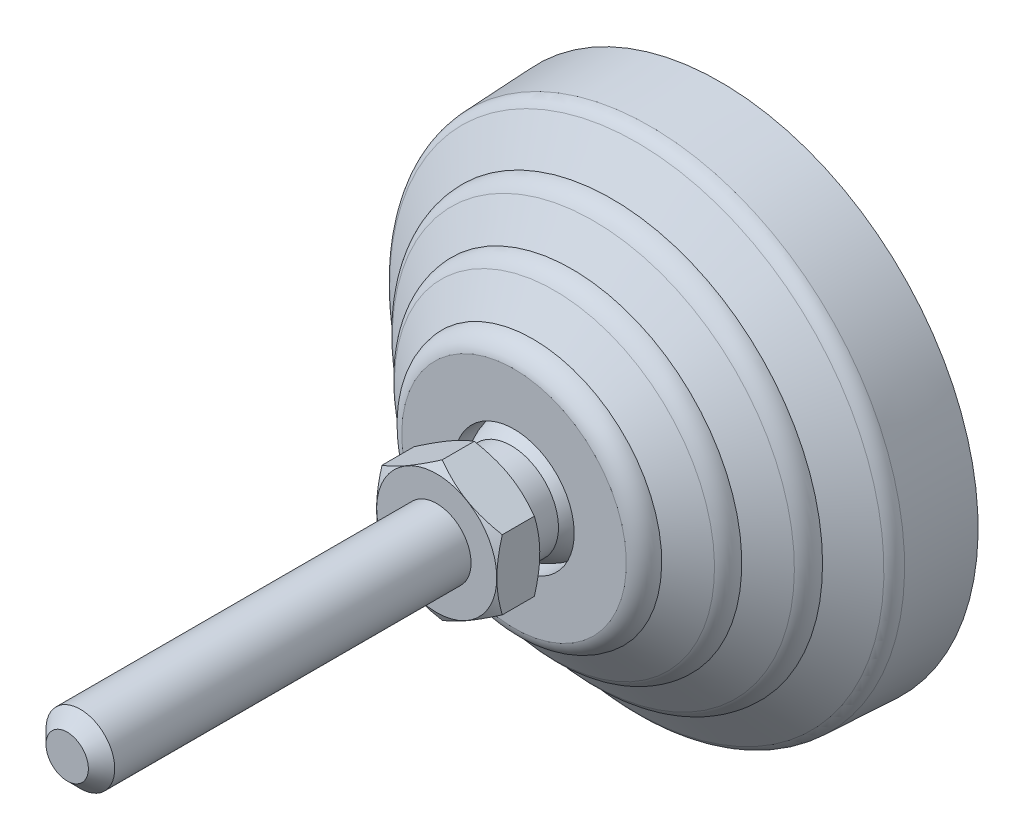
ISO-10303-21;
HEADER;
FILE_DESCRIPTION(('STEP AP214'),'2;1');
FILE_NAME('part.step','',(''),(''),'','','');
FILE_SCHEMA(('AUTOMOTIVE_DESIGN { 1 0 10303 214 1 1 1 1 }'));
ENDSEC;
DATA;
#1=APPLICATION_CONTEXT('core data for automotive mechanical design processes');
#2=APPLICATION_PROTOCOL_DEFINITION('international standard','automotive_design',2000,#1);
#3=PRODUCT_CONTEXT('',#1,'mechanical');
#4=PRODUCT('Part','Part','',(#3));
#5=PRODUCT_RELATED_PRODUCT_CATEGORY('part','',(#4));
#6=PRODUCT_DEFINITION_FORMATION('','',#4);
#7=PRODUCT_DEFINITION_CONTEXT('part definition',#1,'design');
#8=PRODUCT_DEFINITION('design','',#6,#7);
#9=PRODUCT_DEFINITION_SHAPE('','',#8);
#10=(LENGTH_UNIT() NAMED_UNIT(*) SI_UNIT(.MILLI.,.METRE.));
#11=(NAMED_UNIT(*) PLANE_ANGLE_UNIT() SI_UNIT($,.RADIAN.));
#12=(NAMED_UNIT(*) SI_UNIT($,.STERADIAN.) SOLID_ANGLE_UNIT());
#13=UNCERTAINTY_MEASURE_WITH_UNIT(LENGTH_MEASURE(1.E-05),#10,'distance_accuracy_value','');
#14=(GEOMETRIC_REPRESENTATION_CONTEXT(3) GLOBAL_UNCERTAINTY_ASSIGNED_CONTEXT((#13)) GLOBAL_UNIT_ASSIGNED_CONTEXT((#10,
#11,#12)) REPRESENTATION_CONTEXT('',''));
#15=CARTESIAN_POINT('',(0.,0.,0.));
#16=DIRECTION('',(0.,0.,1.));
#17=DIRECTION('',(1.,0.,0.));
#18=AXIS2_PLACEMENT_3D('',#15,#16,#17);
#19=CARTESIAN_POINT('',(0.6165,-1.06780932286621,76.));
#20=DIRECTION('',(0.,0.,1.));
#21=DIRECTION('',(-0.866025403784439,-0.5,0.));
#22=AXIS2_PLACEMENT_3D('',#19,#20,#21);
#23=PLANE('',#22);
#24=CARTESIAN_POINT('',(0.,0.,76.0000000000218));
#25=DIRECTION('',(0.,0.,-1.));
#26=DIRECTION('',(0.866025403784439,0.5,0.));
#27=AXIS2_PLACEMENT_3D('',#24,#25,#26);
#28=CIRCLE('',#27,2.46600000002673);
#29=CARTESIAN_POINT('',(2.13561864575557,1.23300000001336,76.0000000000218));
#30=VERTEX_POINT('',#29);
#31=EDGE_CURVE('E133',#30,#30,#28,.T.);
#32=ORIENTED_EDGE('',*,*,#31,.F.);
#33=EDGE_LOOP('',(#32));
#34=FACE_BOUND('',#33,.T.);
#35=ADVANCED_FACE('F14',(#34),#23,.T.);
#36=CARTESIAN_POINT('',(0.,0.,74.4660000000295));
#37=DIRECTION('',(0.,0.,-1.));
#38=DIRECTION('',(0.866025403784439,0.5,0.));
#39=AXIS2_PLACEMENT_3D('',#36,#37,#38);
#40=CONICAL_SURFACE('',#39,4.0000000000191,0.785398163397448);
#41=CARTESIAN_POINT('',(0.,0.,74.466));
#42=DIRECTION('',(0.,0.,-1.));
#43=DIRECTION('',(0.866025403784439,0.5,0.));
#44=AXIS2_PLACEMENT_3D('',#41,#42,#43);
#45=CIRCLE('',#44,4.);
#46=CARTESIAN_POINT('',(3.46410161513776,2.,74.466));
#47=VERTEX_POINT('',#46);
#48=EDGE_CURVE('E9',#47,#47,#45,.T.);
#49=ORIENTED_EDGE('',*,*,#48,.F.);
#50=EDGE_LOOP('',(#49));
#51=FACE_BOUND('',#50,.T.);
#52=ORIENTED_EDGE('',*,*,#31,.T.);
#53=EDGE_LOOP('',(#52));
#54=FACE_BOUND('',#53,.T.);
#55=ADVANCED_FACE('F309',(#51,#54),#40,.T.);
#56=CARTESIAN_POINT('',(0.,0.,53.733));
#57=DIRECTION('',(0.,0.,-1.));
#58=DIRECTION('',(0.866025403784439,0.5,0.));
#59=AXIS2_PLACEMENT_3D('',#56,#57,#58);
#60=CYLINDRICAL_SURFACE('',#59,4.);
#61=CARTESIAN_POINT('',(0.,0.,33.));
#62=DIRECTION('',(0.,0.,-1.));
#63=DIRECTION('',(0.866025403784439,0.5,0.));
#64=AXIS2_PLACEMENT_3D('',#61,#62,#63);
#65=CIRCLE('',#64,4.);
#66=CARTESIAN_POINT('',(3.46410161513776,2.,33.));
#67=VERTEX_POINT('',#66);
#68=EDGE_CURVE('E26',#67,#67,#65,.F.);
#69=ORIENTED_EDGE('',*,*,#68,.T.);
#70=EDGE_LOOP('',(#69));
#71=FACE_BOUND('',#70,.T.);
#72=ORIENTED_EDGE('',*,*,#48,.T.);
#73=EDGE_LOOP('',(#72));
#74=FACE_BOUND('',#73,.T.);
#75=ADVANCED_FACE('F315',(#71,#74),#60,.T.);
#76=CARTESIAN_POINT('',(2.7475,-4.75880959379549,33.));
#77=DIRECTION('',(0.,0.,1.));
#78=DIRECTION('',(-0.866025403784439,-0.5,0.));
#79=AXIS2_PLACEMENT_3D('',#76,#77,#78);
#80=PLANE('',#79);
#81=CARTESIAN_POINT('',(0.,0.,33.));
#82=DIRECTION('',(0.,0.,-1.));
#83=DIRECTION('',(0.866025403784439,0.5,0.));
#84=AXIS2_PLACEMENT_3D('',#81,#82,#83);
#85=CIRCLE('',#84,6.99);
#86=CARTESIAN_POINT('',(6.05351757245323,3.495,33.));
#87=VERTEX_POINT('',#86);
#88=EDGE_CURVE('E136',#87,#87,#85,.F.);
#89=ORIENTED_EDGE('',*,*,#88,.T.);
#90=EDGE_LOOP('',(#89));
#91=FACE_BOUND('',#90,.T.);
#92=ORIENTED_EDGE('',*,*,#68,.F.);
#93=EDGE_LOOP('',(#92));
#94=FACE_BOUND('',#93,.T.);
#95=ADVANCED_FACE('F161',(#91,#94),#80,.T.);
#96=CARTESIAN_POINT('',(0.,0.,32.3652257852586));
#97=DIRECTION('',(0.,0.,-1.));
#98=DIRECTION('',(0.866025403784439,0.5,0.));
#99=AXIS2_PLACEMENT_3D('',#96,#97,#98);
#100=CONICAL_SURFACE('',#99,8.08946119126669,1.0471975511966);
#101=ORIENTED_EDGE('',*,*,#88,.F.);
#102=EDGE_LOOP('',(#101));
#103=FACE_BOUND('',#102,.T.);
#104=CARTESIAN_POINT('',(-7.00000002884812,-4.0414518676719,32.3690117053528));
#105=CARTESIAN_POINT('',(-6.84613380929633,-4.13028657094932,32.4202905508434));
#106=CARTESIAN_POINT('',(-6.69169390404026,-4.21945249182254,32.4692419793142));
#107=CARTESIAN_POINT('',(-6.38155989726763,-4.39850844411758,32.5618490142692));
#108=CARTESIAN_POINT('',(-6.22586528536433,-4.48839877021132,32.6055023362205));
#109=CARTESIAN_POINT('',(-5.75628875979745,-4.75950890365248,32.7276582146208));
#110=CARTESIAN_POINT('',(-5.44055332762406,-4.94179884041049,32.79713799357));
#111=CARTESIAN_POINT('',(-4.96806103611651,-5.2145923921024,32.8786092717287));
#112=CARTESIAN_POINT('',(-4.81271579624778,-5.30428100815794,32.9018176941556));
#113=CARTESIAN_POINT('',(-4.50132349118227,-5.48406343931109,32.9407338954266));
#114=CARTESIAN_POINT('',(-4.34527648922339,-5.57415721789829,32.9564423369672));
#115=CARTESIAN_POINT('',(-4.03291155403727,-5.75450119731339,32.9799582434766));
#116=CARTESIAN_POINT('',(-3.87659413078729,-5.84475110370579,32.9877746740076));
#117=CARTESIAN_POINT('',(-3.56382362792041,-6.02532923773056,32.9953473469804));
#118=CARTESIAN_POINT('',(-3.40737055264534,-6.11565746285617,32.9951038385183));
#119=CARTESIAN_POINT('',(-2.97876700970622,-6.36311183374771,32.9833586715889));
#120=CARTESIAN_POINT('',(-2.70675692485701,-6.52015692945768,32.9636515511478));
#121=CARTESIAN_POINT('',(-2.16454337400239,-6.83320406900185,32.9011668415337));
#122=CARTESIAN_POINT('',(-1.89434181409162,-6.9892050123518,32.8583679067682));
#123=CARTESIAN_POINT('',(-1.35103755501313,-7.30288187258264,32.7513856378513));
#124=CARTESIAN_POINT('',(-1.07800339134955,-7.46051822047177,32.6867491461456));
#125=CARTESIAN_POINT('',(-0.536006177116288,-7.77344045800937,32.5400514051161));
#126=CARTESIAN_POINT('',(-0.267036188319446,-7.92873035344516,32.4580246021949));
#127=CARTESIAN_POINT('',(-7.50026516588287E-08,-8.08290372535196,32.3690117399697));
#128=B_SPLINE_CURVE_WITH_KNOTS('',3,(#104,#105,#106,#107,#108,#109,#110,#111,#112,#113,#114,
#115,#116,#117,#118,#119,#120,#121,#122,#123,#124,#125,#126,#127),.UNSPECIFIED.,.F.,.F.,(4,2,2,
2,2,2,2,2,2,2,2,4),(0.,0.554720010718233,1.1096783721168,2.22190069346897,2.76439121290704,
3.30683378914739,3.84865943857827,4.39046834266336,5.33360245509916,6.27760987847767,
7.24255086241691,8.20559807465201),.UNSPECIFIED.);
#129=CARTESIAN_POINT('',(-7.00000001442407,-4.04145187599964,32.3690117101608));
#130=VERTEX_POINT('',#129);
#131=CARTESIAN_POINT('',(-1.44240652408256E-08,-8.0829037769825,32.3690117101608));
#132=VERTEX_POINT('',#131);
#133=EDGE_CURVE('E147',#130,#132,#128,.T.);
#134=ORIENTED_EDGE('',*,*,#133,.T.);
#135=CARTESIAN_POINT('',(-2.88481257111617E-08,-8.08290378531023,32.3690117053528));
#136=CARTESIAN_POINT('',(0.287315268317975,-7.91702222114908,32.4647934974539));
#137=CARTESIAN_POINT('',(0.576903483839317,-7.7498283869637,32.5524844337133));
#138=CARTESIAN_POINT('',(1.16078407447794,-7.41272477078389,32.7074672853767));
#139=CARTESIAN_POINT('',(1.45508545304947,-7.24280979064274,32.7747135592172));
#140=CARTESIAN_POINT('',(2.04038588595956,-6.90488642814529,32.882853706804));
#141=CARTESIAN_POINT('',(2.33130253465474,-6.73692562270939,32.9243241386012));
#142=CARTESIAN_POINT('',(2.91481423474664,-6.40003498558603,32.9799957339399));
#143=CARTESIAN_POINT('',(3.20740711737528,-6.23110640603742,32.9942264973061));
#144=CARTESIAN_POINT('',(3.79259287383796,-5.89324925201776,32.9942264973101));
#145=CARTESIAN_POINT('',(4.085185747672,-5.72432067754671,32.9799957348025));
#146=CARTESIAN_POINT('',(4.66869743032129,-5.38743005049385,32.9243241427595));
#147=CARTESIAN_POINT('',(4.95961407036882,-5.21946925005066,32.8828537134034));
#148=CARTESIAN_POINT('',(5.54491448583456,-4.88154589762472,32.7747135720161));
#149=CARTESIAN_POINT('',(5.83921585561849,-4.71163092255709,32.7074673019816));
#150=CARTESIAN_POINT('',(6.42309642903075,-4.37452731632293,32.5524844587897));
#151=CARTESIAN_POINT('',(6.71268463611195,-4.20733348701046,32.4647935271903));
#152=CARTESIAN_POINT('',(6.99999992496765,-4.04145192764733,32.3690117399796));
#153=B_SPLINE_CURVE_WITH_KNOTS('',3,(#135,#136,#137,#138,#139,#140,#141,#142,#143,#144,#145,
#146,#147,#148,#149,#150,#151,#152),.UNSPECIFIED.,.F.,.F.,(4,2,2,2,2,2,2,2,4),(0.,
1.03625689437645,2.07481046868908,3.08920803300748,4.10250268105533,5.11579729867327,
6.13019483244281,7.1687483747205,8.20500523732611),.UNSPECIFIED.);
#154=CARTESIAN_POINT('',(7.,-4.04145190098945,32.3690117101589));
#155=VERTEX_POINT('',#154);
#156=EDGE_CURVE('E139',#132,#155,#153,.T.);
#157=ORIENTED_EDGE('',*,*,#156,.T.);
#158=CARTESIAN_POINT('',(7.,-4.04145191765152,32.3690117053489));
#159=CARTESIAN_POINT('',(7.,-3.86378251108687,32.4202905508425));
#160=CARTESIAN_POINT('',(7.,-3.68545066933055,32.4692419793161));
#161=CARTESIAN_POINT('',(7.,-3.32733876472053,32.5618490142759));
#162=CARTESIAN_POINT('',(7.,-3.14755811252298,32.6055023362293));
#163=CARTESIAN_POINT('',(7.,-2.6053378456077,32.7276582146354));
#164=CARTESIAN_POINT('',(7.,-2.24075797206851,32.797137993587));
#165=CARTESIAN_POINT('',(7.,-1.69517086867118,32.8786092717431));
#166=CARTESIAN_POINT('',(7.,-1.51579363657,32.9018176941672));
#167=CARTESIAN_POINT('',(7.,-1.15622877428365,32.9407338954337));
#168=CARTESIAN_POINT('',(7.,-0.976041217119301,32.9564423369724));
#169=CARTESIAN_POINT('',(7.,-0.615353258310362,32.9799582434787));
#170=CARTESIAN_POINT('',(7.,-0.434853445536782,32.9877746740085));
#171=CARTESIAN_POINT('',(7.,-0.0736971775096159,32.9953473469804));
#172=CARTESIAN_POINT('',(7.,0.106959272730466,32.9951038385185));
#173=CARTESIAN_POINT('',(7.,0.60186801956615,32.9833586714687));
#174=CARTESIAN_POINT('',(7.,0.915958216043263,32.9636515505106));
#175=CARTESIAN_POINT('',(7.,1.54205250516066,32.9011668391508));
#176=CARTESIAN_POINT('',(7.,1.85405439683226,32.8583679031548));
#177=CARTESIAN_POINT('',(7.,2.48140812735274,32.7513856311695));
#178=CARTESIAN_POINT('',(7.,2.79668082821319,32.6867491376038));
#179=CARTESIAN_POINT('',(7.,3.42252531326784,32.5400513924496));
#180=CARTESIAN_POINT('',(7.,3.73310510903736,32.4580245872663));
#181=CARTESIAN_POINT('',(7.,4.04145185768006,32.3690117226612));
#182=B_SPLINE_CURVE_WITH_KNOTS('',3,(#158,#159,#160,#161,#162,#163,#164,#165,#166,#167,#168,
#169,#170,#171,#172,#173,#174,#175,#176,#177,#178,#179,#180,#181),.UNSPECIFIED.,.F.,.F.,(4,2,2,
2,2,2,2,2,2,2,2,4),(0.,0.554720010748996,1.10967837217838,2.22190069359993,2.7643912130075,
3.30683378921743,3.84865943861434,4.39046834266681,5.33360247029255,6.27760990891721,
7.24255090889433,8.20559813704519),.UNSPECIFIED.);
#183=CARTESIAN_POINT('',(6.99999998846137,4.04145189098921,32.369011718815));
#184=VERTEX_POINT('',#183);
#185=EDGE_CURVE('E184',#155,#184,#182,.T.);
#186=ORIENTED_EDGE('',*,*,#185,.T.);
#187=CARTESIAN_POINT('',(6.99999997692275,4.04145189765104,32.3690117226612));
#188=CARTESIAN_POINT('',(6.84613375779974,4.1302866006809,32.4202905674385));
#189=CARTESIAN_POINT('',(6.69169385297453,4.21945252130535,32.4692419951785));
#190=CARTESIAN_POINT('',(6.38155984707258,4.39850847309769,32.5618490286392));
#191=CARTESIAN_POINT('',(6.22586523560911,4.48839879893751,32.6055023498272));
#192=CARTESIAN_POINT('',(5.75628871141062,4.75950893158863,32.7276582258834));
#193=CARTESIAN_POINT('',(5.44055328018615,4.94179886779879,32.7971380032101));
#194=CARTESIAN_POINT('',(4.96806099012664,5.21459241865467,32.878609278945));
#195=CARTESIAN_POINT('',(4.81271575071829,5.3042810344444,32.9018177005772));
#196=CARTESIAN_POINT('',(4.50132344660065,5.4840634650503,32.9407339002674));
#197=CARTESIAN_POINT('',(4.34527644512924,5.57415724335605,32.9564423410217));
#198=CARTESIAN_POINT('',(4.03291151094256,5.75450122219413,32.9799582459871));
#199=CARTESIAN_POINT('',(3.8765940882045,5.84475112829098,32.98777467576));
#200=CARTESIAN_POINT('',(3.56382358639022,6.02532926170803,32.9953473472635));
#201=CARTESIAN_POINT('',(3.40737051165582,6.11565748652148,32.99510383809));
#202=CARTESIAN_POINT('',(2.97876697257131,6.36311185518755,32.9833586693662));
#203=CARTESIAN_POINT('',(2.70675689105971,6.52015694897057,32.9636515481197));
#204=CARTESIAN_POINT('',(2.16454334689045,6.83320408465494,32.9011668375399));
#205=CARTESIAN_POINT('',(1.89434179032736,6.9892050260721,32.8583679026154));
#206=CARTESIAN_POINT('',(1.35103753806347,7.30288188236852,32.7513856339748));
#207=CARTESIAN_POINT('',(1.07800337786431,7.46051822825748,32.6867491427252));
#208=CARTESIAN_POINT('',(0.536006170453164,7.77344046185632,32.5400514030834));
#209=CARTESIAN_POINT('',(0.267036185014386,7.92873035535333,32.4580246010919));
#210=CARTESIAN_POINT('',(7.50026516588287E-08,8.08290372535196,32.3690117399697));
#211=B_SPLINE_CURVE_WITH_KNOTS('',3,(#187,#188,#189,#190,#191,#192,#193,#194,#195,#196,#197,
#198,#199,#200,#201,#202,#203,#204,#205,#206,#207,#208,#209,#210),.UNSPECIFIED.,.F.,.F.,(4,2,2,
2,2,2,2,2,2,2,2,4),(0.,0.554720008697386,1.10967836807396,2.22190068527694,2.76439120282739,
3.30683377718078,3.8486594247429,4.390468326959,5.33360242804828,6.27760984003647,
7.24255081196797,8.20559801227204),.UNSPECIFIED.);
#212=CARTESIAN_POINT('',(1.44240652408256E-08,8.0829037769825,32.3690117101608));
#213=VERTEX_POINT('',#212);
#214=EDGE_CURVE('E176',#184,#213,#211,.T.);
#215=ORIENTED_EDGE('',*,*,#214,.T.);
#216=CARTESIAN_POINT('',(2.88481257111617E-08,8.08290378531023,32.3690117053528));
#217=CARTESIAN_POINT('',(-0.287315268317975,7.91702222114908,32.4647934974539));
#218=CARTESIAN_POINT('',(-0.576903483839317,7.7498283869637,32.5524844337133));
#219=CARTESIAN_POINT('',(-1.16078407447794,7.41272477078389,32.7074672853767));
#220=CARTESIAN_POINT('',(-1.45508545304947,7.24280979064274,32.7747135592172));
#221=CARTESIAN_POINT('',(-2.04038588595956,6.90488642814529,32.882853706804));
#222=CARTESIAN_POINT('',(-2.33130253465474,6.73692562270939,32.9243241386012));
#223=CARTESIAN_POINT('',(-2.91481423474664,6.40003498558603,32.9799957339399));
#224=CARTESIAN_POINT('',(-3.20740711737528,6.23110640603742,32.9942264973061));
#225=CARTESIAN_POINT('',(-3.79259287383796,5.89324925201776,32.9942264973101));
#226=CARTESIAN_POINT('',(-4.085185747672,5.72432067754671,32.9799957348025));
#227=CARTESIAN_POINT('',(-4.66869743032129,5.38743005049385,32.9243241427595));
#228=CARTESIAN_POINT('',(-4.95961407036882,5.21946925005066,32.8828537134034));
#229=CARTESIAN_POINT('',(-5.54491448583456,4.88154589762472,32.7747135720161));
#230=CARTESIAN_POINT('',(-5.83921585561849,4.71163092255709,32.7074673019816));
#231=CARTESIAN_POINT('',(-6.42309642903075,4.37452731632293,32.5524844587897));
#232=CARTESIAN_POINT('',(-6.71268463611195,4.20733348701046,32.4647935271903));
#233=CARTESIAN_POINT('',(-6.99999992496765,4.04145192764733,32.3690117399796));
#234=B_SPLINE_CURVE_WITH_KNOTS('',3,(#216,#217,#218,#219,#220,#221,#222,#223,#224,#225,#226,
#227,#228,#229,#230,#231,#232,#233),.UNSPECIFIED.,.F.,.F.,(4,2,2,2,2,2,2,2,4),(0.,
1.03625689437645,2.07481046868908,3.08920803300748,4.10250268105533,5.11579729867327,
6.13019483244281,7.1687483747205,8.20500523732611),.UNSPECIFIED.);
#235=CARTESIAN_POINT('',(-7.,4.04145190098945,32.3690117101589));
#236=VERTEX_POINT('',#235);
#237=EDGE_CURVE('E343',#213,#236,#234,.T.);
#238=ORIENTED_EDGE('',*,*,#237,.T.);
#239=CARTESIAN_POINT('',(-7.,4.04145191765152,32.3690117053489));
#240=CARTESIAN_POINT('',(-7.,3.86378251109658,32.4202905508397));
#241=CARTESIAN_POINT('',(-7.,3.68545066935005,32.4692419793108));
#242=CARTESIAN_POINT('',(-7.,3.32733876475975,32.5618490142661));
#243=CARTESIAN_POINT('',(-7.,3.14755811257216,32.6055023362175));
#244=CARTESIAN_POINT('',(-7.,2.60533784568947,32.7276582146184));
#245=CARTESIAN_POINT('',(-7.,2.24075797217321,32.7971379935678));
#246=CARTESIAN_POINT('',(-7.,1.69517086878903,32.8786092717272));
#247=CARTESIAN_POINT('',(-7.,1.51579363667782,32.9018176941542));
#248=CARTESIAN_POINT('',(-7.,1.15622877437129,32.9407338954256));
#249=CARTESIAN_POINT('',(-7.,0.97604121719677,32.9564423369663));
#250=CARTESIAN_POINT('',(-7.,0.615353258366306,32.9799582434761));
#251=CARTESIAN_POINT('',(-7.,0.434853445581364,32.9877746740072));
#252=CARTESIAN_POINT('',(-7.,0.0736971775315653,32.9953473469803));
#253=CARTESIAN_POINT('',(-7.,-0.106959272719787,32.9951038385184));
#254=CARTESIAN_POINT('',(-7.,-0.601868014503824,32.9833586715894));
#255=CARTESIAN_POINT('',(-7.,-0.915958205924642,32.9636515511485));
#256=CARTESIAN_POINT('',(-7.,-1.54205248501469,32.9011668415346));
#257=CARTESIAN_POINT('',(-7.,-1.85405437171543,32.8583679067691));
#258=CARTESIAN_POINT('',(-7.,-2.48140809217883,32.7513856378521));
#259=CARTESIAN_POINT('',(-7.,-2.79668078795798,32.6867491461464));
#260=CARTESIAN_POINT('',(-7.,-3.42252526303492,32.5400514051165));
#261=CARTESIAN_POINT('',(-7.,-3.73310505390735,32.4580246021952));
#262=CARTESIAN_POINT('',(-7.,-4.0414517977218,32.3690117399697));
#263=B_SPLINE_CURVE_WITH_KNOTS('',3,(#239,#240,#241,#242,#243,#244,#245,#246,#247,#248,#249,
#250,#251,#252,#253,#254,#255,#256,#257,#258,#259,#260,#261,#262),.UNSPECIFIED.,.F.,.F.,(4,2,2,
2,2,2,2,2,2,2,2,4),(0.,0.554720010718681,1.1096783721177,2.22190069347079,2.76439121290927,
3.30683378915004,3.84865943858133,4.39046834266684,5.33360245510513,6.27760987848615,
7.24255086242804,8.20559807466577),.UNSPECIFIED.);
#264=EDGE_CURVE('E166',#236,#130,#263,.T.);
#265=ORIENTED_EDGE('',*,*,#264,.T.);
#266=EDGE_LOOP('',(#134,#157,#186,#215,#238,#265));
#267=FACE_BOUND('',#266,.T.);
#268=ADVANCED_FACE('F156',(#103,#267),#100,.T.);
#269=CARTESIAN_POINT('',(-7.,-4.04145188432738,33.1));
#270=DIRECTION('',(1.,0.,0.));
#271=DIRECTION('',(0.,1.,0.));
#272=AXIS2_PLACEMENT_3D('',#269,#270,#271);
#273=PLANE('',#272);
#274=DIRECTION('',(0.,0.,1.));
#275=VECTOR('',#274,1.);
#276=CARTESIAN_POINT('',(-7.,-4.04145188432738,33.1));
#277=LINE('',#276,#275);
#278=CARTESIAN_POINT('',(-7.,-4.04145188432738,28.6309882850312));
#279=VERTEX_POINT('',#278);
#280=EDGE_CURVE('E369',#279,#130,#277,.T.);
#281=ORIENTED_EDGE('',*,*,#280,.T.);
#282=ORIENTED_EDGE('',*,*,#264,.F.);
#283=DIRECTION('',(0.,0.,1.));
#284=VECTOR('',#283,1.);
#285=CARTESIAN_POINT('',(-7.,4.04145188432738,33.1));
#286=LINE('',#285,#284);
#287=CARTESIAN_POINT('',(-7.,4.04145188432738,28.6309882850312));
#288=VERTEX_POINT('',#287);
#289=EDGE_CURVE('E361',#288,#236,#286,.T.);
#290=ORIENTED_EDGE('',*,*,#289,.F.);
#291=CARTESIAN_POINT('',(-7.,-4.04145188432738,28.6309882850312));
#292=CARTESIAN_POINT('',(-7.,-3.86378247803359,28.5797094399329));
#293=CARTESIAN_POINT('',(-7.,-3.68545063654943,28.5307580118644));
#294=CARTESIAN_POINT('',(-7.,-3.32733873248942,28.4381509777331));
#295=CARTESIAN_POINT('',(-7.,-3.14755808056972,28.3944976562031));
#296=CARTESIAN_POINT('',(-7.,-2.60533781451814,28.2723417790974));
#297=CARTESIAN_POINT('',(-7.,-2.24075794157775,28.2028620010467));
#298=CARTESIAN_POINT('',(-7.,-1.69517083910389,28.1213907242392));
#299=CARTESIAN_POINT('',(-7.,-1.51579360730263,28.098182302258));
#300=CARTESIAN_POINT('',(-7.,-1.15622874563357,28.0592661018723));
#301=CARTESIAN_POINT('',(-7.,-0.976041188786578,28.0435576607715));
#302=CARTESIAN_POINT('',(-7.,-0.615353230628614,28.0200417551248));
#303=CARTESIAN_POINT('',(-7.,-0.434853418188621,28.012225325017));
#304=CARTESIAN_POINT('',(-7.,-0.0736971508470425,28.0046526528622));
#305=CARTESIAN_POINT('',(-7.,0.10695929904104,28.0048961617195));
#306=CARTESIAN_POINT('',(-7.,0.601868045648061,28.0166413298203));
#307=CARTESIAN_POINT('',(-7.,0.91595824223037,28.0363484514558));
#308=CARTESIAN_POINT('',(-7.,1.54205253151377,28.0988331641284));
#309=CARTESIAN_POINT('',(-7.,1.85405442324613,28.1416321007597));
#310=CARTESIAN_POINT('',(-7.,2.48140815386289,28.248614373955));
#311=CARTESIAN_POINT('',(-7.,2.79668085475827,28.3132508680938));
#312=CARTESIAN_POINT('',(-7.,3.4225253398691,28.4599486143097));
#313=CARTESIAN_POINT('',(-7.,3.73310513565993,28.5419754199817));
#314=CARTESIAN_POINT('',(-7.,4.04145188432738,28.6309882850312));
#315=B_SPLINE_CURVE_WITH_KNOTS('',3,(#291,#292,#293,#294,#295,#296,#297,#298,#299,#300,#301,
#302,#303,#304,#305,#306,#307,#308,#309,#310,#311,#312,#313,#314),.UNSPECIFIED.,.F.,.F.,(4,2,2,
2,2,2,2,2,2,2,2,4),(0.,0.554720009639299,1.10967836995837,2.22190068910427,2.76439120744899,
3.30683378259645,3.84865943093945,4.39046833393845,5.3336024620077,6.2776099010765,
7.24255090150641,8.20559813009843),.UNSPECIFIED.);
#316=EDGE_CURVE('E363',#279,#288,#315,.T.);
#317=ORIENTED_EDGE('',*,*,#316,.F.);
#318=EDGE_LOOP('',(#281,#282,#290,#317));
#319=FACE_BOUND('',#318,.T.);
#320=ADVANCED_FACE('F160',(#319),#273,.F.);
#321=CARTESIAN_POINT('',(0.,-8.08290376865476,33.1));
#322=DIRECTION('',(0.5,0.866025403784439,0.));
#323=DIRECTION('',(-0.866025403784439,0.5,0.));
#324=AXIS2_PLACEMENT_3D('',#321,#322,#323);
#325=PLANE('',#324);
#326=DIRECTION('',(0.,0.,1.));
#327=VECTOR('',#326,1.);
#328=CARTESIAN_POINT('',(0.,-8.08290376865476,33.1));
#329=LINE('',#328,#327);
#330=CARTESIAN_POINT('',(0.,-8.08290376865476,28.6309882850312));
#331=VERTEX_POINT('',#330);
#332=EDGE_CURVE('E35',#331,#132,#329,.T.);
#333=ORIENTED_EDGE('',*,*,#332,.T.);
#334=ORIENTED_EDGE('',*,*,#133,.F.);
#335=ORIENTED_EDGE('',*,*,#280,.F.);
#336=CARTESIAN_POINT('',(0.,-8.08290376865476,28.6309882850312));
#337=CARTESIAN_POINT('',(-0.15386621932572,-7.99406906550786,28.5797094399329));
#338=CARTESIAN_POINT('',(-0.308306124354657,-7.90490314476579,28.5307580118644));
#339=CARTESIAN_POINT('',(-0.618440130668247,-7.72584719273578,28.4381509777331));
#340=CARTESIAN_POINT('',(-0.774134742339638,-7.63595686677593,28.3944976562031));
#341=CARTESIAN_POINT('',(-1.24371126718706,-7.36484673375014,28.2723417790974));
#342=CARTESIAN_POINT('',(-1.55944669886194,-7.18255679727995,28.2028620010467));
#343=CARTESIAN_POINT('',(-2.03193898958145,-6.90976324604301,28.1213907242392));
#344=CARTESIAN_POINT('',(-2.18728422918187,-6.82007463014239,28.098182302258));
#345=CARTESIAN_POINT('',(-2.49867653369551,-6.64029219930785,28.0592661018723));
#346=CARTESIAN_POINT('',(-2.65472353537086,-6.55019842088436,28.0435576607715));
#347=CARTESIAN_POINT('',(-2.96708846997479,-6.36985444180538,28.0200417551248));
#348=CARTESIAN_POINT('',(-3.12340589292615,-6.27960453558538,28.012225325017));
#349=CARTESIAN_POINT('',(-3.43617639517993,-6.09902640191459,28.0046526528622));
#350=CARTESIAN_POINT('',(-3.59262947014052,-6.00869817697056,28.0048961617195));
#351=CARTESIAN_POINT('',(-4.02123301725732,-5.76124380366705,28.0166413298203));
#352=CARTESIAN_POINT('',(-4.29324310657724,-5.60419870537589,28.0363484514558));
#353=CARTESIAN_POINT('',(-4.83545666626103,-5.29115156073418,28.0988331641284));
#354=CARTESIAN_POINT('',(-5.10565823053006,-5.135150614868,28.1416321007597));
#355=CARTESIAN_POINT('',(-5.64896249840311,-4.82147374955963,28.248614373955));
#356=CARTESIAN_POINT('',(-5.92199666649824,-4.66383739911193,28.3132508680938));
#357=CARTESIAN_POINT('',(-6.46399388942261,-4.35091515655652,28.4599486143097));
#358=CARTESIAN_POINT('',(-6.73296388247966,-4.1956252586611,28.5419754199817));
#359=CARTESIAN_POINT('',(-7.,-4.04145188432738,28.6309882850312));
#360=B_SPLINE_CURVE_WITH_KNOTS('',3,(#336,#337,#338,#339,#340,#341,#342,#343,#344,#345,#346,
#347,#348,#349,#350,#351,#352,#353,#354,#355,#356,#357,#358,#359),.UNSPECIFIED.,.F.,.F.,(4,2,2,
2,2,2,2,2,2,2,2,4),(0.,0.554720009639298,1.10967836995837,2.22190068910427,2.76439120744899,
3.30683378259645,3.84865943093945,4.39046833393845,5.3336024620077,6.2776099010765,
7.24255090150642,8.20559813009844),.UNSPECIFIED.);
#361=EDGE_CURVE('E370',#331,#279,#360,.T.);
#362=ORIENTED_EDGE('',*,*,#361,.F.);
#363=EDGE_LOOP('',(#333,#334,#335,#362));
#364=FACE_BOUND('',#363,.T.);
#365=ADVANCED_FACE('F376',(#364),#325,.F.);
#366=CARTESIAN_POINT('',(0.,8.08290376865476,33.1));
#367=DIRECTION('',(-0.5,-0.866025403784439,0.));
#368=DIRECTION('',(0.866025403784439,-0.5,0.));
#369=AXIS2_PLACEMENT_3D('',#366,#367,#368);
#370=PLANE('',#369);
#371=DIRECTION('',(0.,0.,1.));
#372=VECTOR('',#371,1.);
#373=CARTESIAN_POINT('',(0.,8.08290376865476,33.1));
#374=LINE('',#373,#372);
#375=CARTESIAN_POINT('',(0.,8.08290376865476,28.6309882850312));
#376=VERTEX_POINT('',#375);
#377=EDGE_CURVE('E362',#376,#213,#374,.T.);
#378=ORIENTED_EDGE('',*,*,#377,.T.);
#379=ORIENTED_EDGE('',*,*,#214,.F.);
#380=DIRECTION('',(0.,0.,1.));
#381=VECTOR('',#380,1.);
#382=CARTESIAN_POINT('',(7.,4.04145188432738,33.1));
#383=LINE('',#382,#381);
#384=CARTESIAN_POINT('',(7.,4.04145188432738,28.6309882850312));
#385=VERTEX_POINT('',#384);
#386=EDGE_CURVE('E215',#385,#184,#383,.T.);
#387=ORIENTED_EDGE('',*,*,#386,.F.);
#388=CARTESIAN_POINT('',(0.,8.08290376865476,28.6309882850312));
#389=CARTESIAN_POINT('',(0.153866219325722,7.99406906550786,28.5797094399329));
#390=CARTESIAN_POINT('',(0.308306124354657,7.90490314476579,28.5307580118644));
#391=CARTESIAN_POINT('',(0.618440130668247,7.72584719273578,28.4381509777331));
#392=CARTESIAN_POINT('',(0.774134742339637,7.63595686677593,28.3944976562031));
#393=CARTESIAN_POINT('',(1.24371126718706,7.36484673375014,28.2723417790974));
#394=CARTESIAN_POINT('',(1.55944669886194,7.18255679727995,28.2028620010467));
#395=CARTESIAN_POINT('',(2.03193898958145,6.90976324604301,28.1213907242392));
#396=CARTESIAN_POINT('',(2.18728422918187,6.82007463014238,28.098182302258));
#397=CARTESIAN_POINT('',(2.49867653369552,6.64029219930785,28.0592661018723));
#398=CARTESIAN_POINT('',(2.65472353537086,6.55019842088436,28.0435576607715));
#399=CARTESIAN_POINT('',(2.9670884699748,6.36985444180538,28.0200417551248));
#400=CARTESIAN_POINT('',(3.12340589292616,6.27960453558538,28.0122253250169));
#401=CARTESIAN_POINT('',(3.43617639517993,6.09902640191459,28.0046526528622));
#402=CARTESIAN_POINT('',(3.59262947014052,6.00869817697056,28.0048961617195));
#403=CARTESIAN_POINT('',(4.02123301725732,5.76124380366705,28.0166413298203));
#404=CARTESIAN_POINT('',(4.29324310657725,5.60419870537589,28.0363484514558));
#405=CARTESIAN_POINT('',(4.83545666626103,5.29115156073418,28.0988331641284));
#406=CARTESIAN_POINT('',(5.10565823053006,5.135150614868,28.1416321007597));
#407=CARTESIAN_POINT('',(5.64896249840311,4.82147374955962,28.248614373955));
#408=CARTESIAN_POINT('',(5.92199666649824,4.66383739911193,28.3132508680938));
#409=CARTESIAN_POINT('',(6.46399388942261,4.35091515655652,28.4599486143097));
#410=CARTESIAN_POINT('',(6.73296388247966,4.1956252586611,28.5419754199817));
#411=CARTESIAN_POINT('',(7.,4.04145188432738,28.6309882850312));
#412=B_SPLINE_CURVE_WITH_KNOTS('',3,(#388,#389,#390,#391,#392,#393,#394,#395,#396,#397,#398,
#399,#400,#401,#402,#403,#404,#405,#406,#407,#408,#409,#410,#411),.UNSPECIFIED.,.F.,.F.,(4,2,2,
2,2,2,2,2,2,2,2,4),(0.,0.554720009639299,1.10967836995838,2.22190068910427,2.76439120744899,
3.30683378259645,3.84865943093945,4.39046833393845,5.33360246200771,6.2776099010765,
7.24255090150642,8.20559813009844),.UNSPECIFIED.);
#413=EDGE_CURVE('E217',#376,#385,#412,.T.);
#414=ORIENTED_EDGE('',*,*,#413,.F.);
#415=EDGE_LOOP('',(#378,#379,#387,#414));
#416=FACE_BOUND('',#415,.T.);
#417=ADVANCED_FACE('F203',(#416),#370,.F.);
#418=CARTESIAN_POINT('',(-7.,4.04145188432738,33.1));
#419=DIRECTION('',(0.5,-0.866025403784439,0.));
#420=DIRECTION('',(0.866025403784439,0.5,0.));
#421=AXIS2_PLACEMENT_3D('',#418,#419,#420);
#422=PLANE('',#421);
#423=ORIENTED_EDGE('',*,*,#289,.T.);
#424=ORIENTED_EDGE('',*,*,#237,.F.);
#425=ORIENTED_EDGE('',*,*,#377,.F.);
#426=CARTESIAN_POINT('',(-7.,4.04145188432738,28.6309882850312));
#427=CARTESIAN_POINT('',(-6.71268470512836,4.20733344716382,28.5352064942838));
#428=CARTESIAN_POINT('',(-6.42309649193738,4.37452728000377,28.4475155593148));
#429=CARTESIAN_POINT('',(-5.83921590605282,4.71163089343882,28.292532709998));
#430=CARTESIAN_POINT('',(-5.54491452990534,4.88154587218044,28.2252864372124));
#431=CARTESIAN_POINT('',(-4.95961410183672,5.21946923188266,28.1171462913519));
#432=CARTESIAN_POINT('',(-4.6686974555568,5.38743003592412,28.075675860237));
#433=CARTESIAN_POINT('',(-4.08518576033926,5.72432067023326,28.0200042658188));
#434=CARTESIAN_POINT('',(-3.79259288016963,5.89324924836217,28.0057735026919));
#435=CARTESIAN_POINT('',(-3.20740711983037,6.23110640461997,28.0057735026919));
#436=CARTESIAN_POINT('',(-2.91481423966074,6.40003498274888,28.0200042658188));
#437=CARTESIAN_POINT('',(-2.3313025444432,6.73692561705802,28.075675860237));
#438=CARTESIAN_POINT('',(-2.04038589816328,6.90488642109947,28.1171462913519));
#439=CARTESIAN_POINT('',(-1.45508547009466,7.2428097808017,28.2252864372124));
#440=CARTESIAN_POINT('',(-1.16078409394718,7.41272475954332,28.292532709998));
#441=CARTESIAN_POINT('',(-0.576903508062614,7.74982837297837,28.4475155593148));
#442=CARTESIAN_POINT('',(-0.287315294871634,7.91702220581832,28.5352064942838));
#443=CARTESIAN_POINT('',(0.,8.08290376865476,28.6309882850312));
#444=B_SPLINE_CURVE_WITH_KNOTS('',3,(#426,#427,#428,#429,#430,#431,#432,#433,#434,#435,#436,
#437,#438,#439,#440,#441,#442,#443),.UNSPECIFIED.,.F.,.F.,(4,2,2,2,2,2,2,2,4),(0.,
1.03625688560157,2.07481045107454,3.08920800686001,4.10250264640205,5.11579728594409,
6.13019484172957,7.16874840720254,8.20500529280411),.UNSPECIFIED.);
#445=EDGE_CURVE('E355',#288,#376,#444,.T.);
#446=ORIENTED_EDGE('',*,*,#445,.F.);
#447=EDGE_LOOP('',(#423,#424,#425,#446));
#448=FACE_BOUND('',#447,.T.);
#449=ADVANCED_FACE('F349',(#448),#422,.F.);
#450=CARTESIAN_POINT('',(7.,-4.04145188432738,33.1));
#451=DIRECTION('',(-0.5,0.866025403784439,0.));
#452=DIRECTION('',(-0.866025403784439,-0.5,0.));
#453=AXIS2_PLACEMENT_3D('',#450,#451,#452);
#454=PLANE('',#453);
#455=DIRECTION('',(0.,0.,1.));
#456=VECTOR('',#455,1.);
#457=CARTESIAN_POINT('',(7.,-4.04145188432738,33.1));
#458=LINE('',#457,#456);
#459=CARTESIAN_POINT('',(7.,-4.04145188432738,28.6309882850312));
#460=VERTEX_POINT('',#459);
#461=EDGE_CURVE('E403',#155,#460,#458,.F.);
#462=ORIENTED_EDGE('',*,*,#461,.F.);
#463=ORIENTED_EDGE('',*,*,#156,.F.);
#464=ORIENTED_EDGE('',*,*,#332,.F.);
#465=CARTESIAN_POINT('',(7.,-4.04145188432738,28.6309882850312));
#466=CARTESIAN_POINT('',(6.71268470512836,-4.20733344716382,28.5352064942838));
#467=CARTESIAN_POINT('',(6.42309649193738,-4.37452728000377,28.4475155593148));
#468=CARTESIAN_POINT('',(5.83921590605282,-4.71163089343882,28.292532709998));
#469=CARTESIAN_POINT('',(5.54491452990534,-4.88154587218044,28.2252864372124));
#470=CARTESIAN_POINT('',(4.95961410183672,-5.21946923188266,28.1171462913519));
#471=CARTESIAN_POINT('',(4.6686974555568,-5.38743003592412,28.075675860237));
#472=CARTESIAN_POINT('',(4.08518576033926,-5.72432067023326,28.0200042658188));
#473=CARTESIAN_POINT('',(3.79259288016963,-5.89324924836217,28.0057735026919));
#474=CARTESIAN_POINT('',(3.20740711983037,-6.23110640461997,28.0057735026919));
#475=CARTESIAN_POINT('',(2.91481423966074,-6.40003498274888,28.0200042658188));
#476=CARTESIAN_POINT('',(2.3313025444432,-6.73692561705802,28.075675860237));
#477=CARTESIAN_POINT('',(2.04038589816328,-6.90488642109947,28.1171462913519));
#478=CARTESIAN_POINT('',(1.45508547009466,-7.2428097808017,28.2252864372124));
#479=CARTESIAN_POINT('',(1.16078409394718,-7.41272475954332,28.292532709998));
#480=CARTESIAN_POINT('',(0.576903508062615,-7.74982837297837,28.4475155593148));
#481=CARTESIAN_POINT('',(0.287315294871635,-7.91702220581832,28.5352064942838));
#482=CARTESIAN_POINT('',(0.,-8.08290376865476,28.6309882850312));
#483=B_SPLINE_CURVE_WITH_KNOTS('',3,(#465,#466,#467,#468,#469,#470,#471,#472,#473,#474,#475,
#476,#477,#478,#479,#480,#481,#482),.UNSPECIFIED.,.F.,.F.,(4,2,2,2,2,2,2,2,4),(0.,
1.03625688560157,2.07481045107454,3.08920800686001,4.10250264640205,5.11579728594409,
6.13019484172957,7.16874840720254,8.20500529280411),.UNSPECIFIED.);
#484=EDGE_CURVE('E192',#460,#331,#483,.T.);
#485=ORIENTED_EDGE('',*,*,#484,.F.);
#486=EDGE_LOOP('',(#462,#463,#464,#485));
#487=FACE_BOUND('',#486,.T.);
#488=ADVANCED_FACE('F154',(#487),#454,.F.);
#489=CARTESIAN_POINT('',(7.,4.04145188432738,33.1));
#490=DIRECTION('',(-1.,0.,0.));
#491=DIRECTION('',(0.,-1.,0.));
#492=AXIS2_PLACEMENT_3D('',#489,#490,#491);
#493=PLANE('',#492);
#494=ORIENTED_EDGE('',*,*,#386,.T.);
#495=ORIENTED_EDGE('',*,*,#185,.F.);
#496=ORIENTED_EDGE('',*,*,#461,.T.);
#497=CARTESIAN_POINT('',(7.,4.04145188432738,28.6309882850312));
#498=CARTESIAN_POINT('',(7.,3.86378247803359,28.5797094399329));
#499=CARTESIAN_POINT('',(7.,3.68545063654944,28.5307580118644));
#500=CARTESIAN_POINT('',(7.,3.32733873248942,28.4381509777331));
#501=CARTESIAN_POINT('',(7.,3.14755808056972,28.3944976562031));
#502=CARTESIAN_POINT('',(7.,2.60533781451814,28.2723417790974));
#503=CARTESIAN_POINT('',(7.,2.24075794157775,28.2028620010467));
#504=CARTESIAN_POINT('',(7.,1.69517083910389,28.1213907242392));
#505=CARTESIAN_POINT('',(7.,1.51579360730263,28.098182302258));
#506=CARTESIAN_POINT('',(7.,1.15622874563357,28.0592661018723));
#507=CARTESIAN_POINT('',(7.,0.976041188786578,28.0435576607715));
#508=CARTESIAN_POINT('',(7.,0.615353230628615,28.0200417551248));
#509=CARTESIAN_POINT('',(7.,0.434853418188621,28.0122253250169));
#510=CARTESIAN_POINT('',(7.,0.0736971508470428,28.0046526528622));
#511=CARTESIAN_POINT('',(7.,-0.10695929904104,28.0048961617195));
#512=CARTESIAN_POINT('',(7.,-0.601868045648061,28.0166413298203));
#513=CARTESIAN_POINT('',(7.,-0.91595824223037,28.0363484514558));
#514=CARTESIAN_POINT('',(7.,-1.54205253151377,28.0988331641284));
#515=CARTESIAN_POINT('',(7.,-1.85405442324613,28.1416321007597));
#516=CARTESIAN_POINT('',(7.,-2.48140815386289,28.248614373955));
#517=CARTESIAN_POINT('',(7.,-2.79668085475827,28.3132508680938));
#518=CARTESIAN_POINT('',(7.,-3.4225253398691,28.4599486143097));
#519=CARTESIAN_POINT('',(7.,-3.73310513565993,28.5419754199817));
#520=CARTESIAN_POINT('',(7.,-4.04145188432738,28.6309882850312));
#521=B_SPLINE_CURVE_WITH_KNOTS('',3,(#497,#498,#499,#500,#501,#502,#503,#504,#505,#506,#507,
#508,#509,#510,#511,#512,#513,#514,#515,#516,#517,#518,#519,#520),.UNSPECIFIED.,.F.,.F.,(4,2,2,
2,2,2,2,2,2,2,2,4),(0.,0.554720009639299,1.10967836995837,2.22190068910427,2.76439120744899,
3.30683378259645,3.84865943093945,4.39046833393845,5.3336024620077,6.2776099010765,
7.24255090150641,8.20559813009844),.UNSPECIFIED.);
#522=EDGE_CURVE('E72',#385,#460,#521,.T.);
#523=ORIENTED_EDGE('',*,*,#522,.F.);
#524=EDGE_LOOP('',(#494,#495,#496,#523));
#525=FACE_BOUND('',#524,.T.);
#526=ADVANCED_FACE('F199',(#525),#493,.F.);
#527=CARTESIAN_POINT('',(0.,0.,28.6347742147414));
#528=DIRECTION('',(0.,0.,1.));
#529=DIRECTION('',(-0.866025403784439,-0.5,0.));
#530=AXIS2_PLACEMENT_3D('',#527,#528,#529);
#531=CONICAL_SURFACE('',#530,8.0894611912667,1.0471975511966);
#532=CARTESIAN_POINT('',(0.,0.,28.));
#533=DIRECTION('',(0.,0.,1.));
#534=DIRECTION('',(-0.866025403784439,-0.5,0.));
#535=AXIS2_PLACEMENT_3D('',#532,#533,#534);
#536=CIRCLE('',#535,6.99);
#537=CARTESIAN_POINT('',(-6.05351757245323,-3.495,28.));
#538=VERTEX_POINT('',#537);
#539=EDGE_CURVE('E216',#538,#538,#536,.T.);
#540=ORIENTED_EDGE('',*,*,#539,.T.);
#541=EDGE_LOOP('',(#540));
#542=FACE_BOUND('',#541,.T.);
#543=ORIENTED_EDGE('',*,*,#522,.T.);
#544=ORIENTED_EDGE('',*,*,#484,.T.);
#545=ORIENTED_EDGE('',*,*,#361,.T.);
#546=ORIENTED_EDGE('',*,*,#316,.T.);
#547=ORIENTED_EDGE('',*,*,#445,.T.);
#548=ORIENTED_EDGE('',*,*,#413,.T.);
#549=EDGE_LOOP('',(#543,#544,#545,#546,#547,#548));
#550=FACE_BOUND('',#549,.T.);
#551=ADVANCED_FACE('F202',(#542,#550),#531,.T.);
#552=CARTESIAN_POINT('',(3.1225,-5.40832864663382,28.));
#553=DIRECTION('',(0.,0.,-1.));
#554=DIRECTION('',(0.866025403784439,0.5,0.));
#555=AXIS2_PLACEMENT_3D('',#552,#553,#554);
#556=PLANE('',#555);
#557=CARTESIAN_POINT('',(0.,0.,28.));
#558=DIRECTION('',(0.,0.,-1.));
#559=DIRECTION('',(0.866025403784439,0.5,0.));
#560=AXIS2_PLACEMENT_3D('',#557,#558,#559);
#561=CIRCLE('',#560,5.5);
#562=CARTESIAN_POINT('',(4.76313972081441,2.75,28.));
#563=VERTEX_POINT('',#562);
#564=EDGE_CURVE('E225',#563,#563,#561,.F.);
#565=ORIENTED_EDGE('',*,*,#564,.T.);
#566=EDGE_LOOP('',(#565));
#567=FACE_BOUND('',#566,.T.);
#568=ORIENTED_EDGE('',*,*,#539,.F.);
#569=EDGE_LOOP('',(#568));
#570=FACE_BOUND('',#569,.T.);
#571=ADVANCED_FACE('F430',(#567,#570),#556,.T.);
#572=CARTESIAN_POINT('',(0.,0.,26.1650635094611));
#573=DIRECTION('',(0.,0.,-1.));
#574=DIRECTION('',(0.866025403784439,0.5,0.));
#575=AXIS2_PLACEMENT_3D('',#572,#573,#574);
#576=CYLINDRICAL_SURFACE('',#575,5.5);
#577=ORIENTED_EDGE('',*,*,#564,.F.);
#578=EDGE_LOOP('',(#577));
#579=FACE_BOUND('',#578,.T.);
#580=CARTESIAN_POINT('',(0.,0.,24.3301270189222));
#581=DIRECTION('',(0.,0.,-1.));
#582=DIRECTION('',(0.866025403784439,0.5,0.));
#583=AXIS2_PLACEMENT_3D('',#580,#581,#582);
#584=CIRCLE('',#583,5.5);
#585=CARTESIAN_POINT('',(4.76313972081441,2.75,24.3301270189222));
#586=VERTEX_POINT('',#585);
#587=EDGE_CURVE('E99',#586,#586,#584,.F.);
#588=ORIENTED_EDGE('',*,*,#587,.T.);
#589=EDGE_LOOP('',(#588));
#590=FACE_BOUND('',#589,.T.);
#591=ADVANCED_FACE('F119',(#579,#590),#576,.T.);
#592=CARTESIAN_POINT('',(0.,0.,20.));
#593=DIRECTION('',(0.5,-0.866025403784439,0.));
#594=DIRECTION('',(0.,0.,1.));
#595=AXIS2_PLACEMENT_3D('',#592,#593,#594);
#596=SPHERICAL_SURFACE('',#595,7.);
#597=CARTESIAN_POINT('',(0.,0.,20.));
#598=DIRECTION('',(0.,0.,1.));
#599=DIRECTION('',(0.5,-0.866025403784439,0.));
#600=AXIS2_PLACEMENT_3D('',#597,#598,#599);
#601=CIRCLE('',#600,7.);
#602=CARTESIAN_POINT('',(6.06217782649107,3.5,19.9999999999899));
#603=VERTEX_POINT('',#602);
#604=CARTESIAN_POINT('',(-3.5,6.06217782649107,20.));
#605=VERTEX_POINT('',#604);
#606=EDGE_CURVE('E81',#603,#605,#601,.T.);
#607=ORIENTED_EDGE('',*,*,#606,.T.);
#608=CARTESIAN_POINT('',(-3.49999999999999,6.06217782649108,20.));
#609=CARTESIAN_POINT('',(-3.59919346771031,6.00491125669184,20.));
#610=CARTESIAN_POINT('',(-3.69697878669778,5.94520611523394,20.));
#611=CARTESIAN_POINT('',(-3.88950334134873,5.82107150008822,20.));
#612=CARTESIAN_POINT('',(-3.98424257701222,5.7566420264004,20.));
#613=CARTESIAN_POINT('',(-4.17044517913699,5.62321155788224,20.));
#614=CARTESIAN_POINT('',(-4.26190854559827,5.55421056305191,20.));
#615=CARTESIAN_POINT('',(-4.4413394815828,5.41180392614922,20.));
#616=CARTESIAN_POINT('',(-4.52930705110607,5.33839828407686,20.));
#617=CARTESIAN_POINT('',(-4.70153436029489,5.18735902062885,20.));
#618=CARTESIAN_POINT('',(-4.78579409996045,5.10972539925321,20.));
#619=CARTESIAN_POINT('',(-4.9504027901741,4.95041724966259,20.));
#620=CARTESIAN_POINT('',(-5.0307517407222,4.86874272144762,20.));
#621=CARTESIAN_POINT('',(-5.18734527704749,4.70154950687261,20.));
#622=CARTESIAN_POINT('',(-5.26358986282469,4.61603082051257,20.));
#623=CARTESIAN_POINT('',(-5.41179099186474,4.44135531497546,20.));
#624=CARTESIAN_POINT('',(-5.4837475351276,4.3521984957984,20.));
#625=CARTESIAN_POINT('',(-5.62319922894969,4.17046151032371,20.));
#626=CARTESIAN_POINT('',(-5.69069437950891,4.0778813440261,20.));
#627=CARTESIAN_POINT('',(-5.82106068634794,3.8895206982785,20.));
#628=CARTESIAN_POINT('',(-5.88393184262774,3.79374021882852,20.));
#629=CARTESIAN_POINT('',(-6.00489869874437,3.59920969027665,20.));
#630=CARTESIAN_POINT('',(-6.0629943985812,3.50045964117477,20.));
#631=CARTESIAN_POINT('',(-6.17427038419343,3.300227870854,20.));
#632=CARTESIAN_POINT('',(-6.22745066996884,3.19874614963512,20.));
#633=CARTESIAN_POINT('',(-6.3287677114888,2.99329551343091,20.));
#634=CARTESIAN_POINT('',(-6.37690446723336,2.8893265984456,20.));
#635=CARTESIAN_POINT('',(-6.46801848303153,2.67915204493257,20.));
#636=CARTESIAN_POINT('',(-6.51099574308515,2.57294640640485,20.));
#637=CARTESIAN_POINT('',(-6.59168723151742,2.35855426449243,20.));
#638=CARTESIAN_POINT('',(-6.62940145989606,2.25036776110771,20.));
#639=CARTESIAN_POINT('',(-6.69947602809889,2.03227452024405,20.));
#640=CARTESIAN_POINT('',(-6.73183636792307,1.92236778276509,20.));
#641=CARTESIAN_POINT('',(-6.79112520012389,1.70109884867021,20.));
#642=CARTESIAN_POINT('',(-6.81805369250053,1.58973665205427,20.));
#643=CARTESIAN_POINT('',(-6.86641395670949,1.36582508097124,20.));
#644=CARTESIAN_POINT('',(-6.88784572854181,1.25327570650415,20.));
#645=CARTESIAN_POINT('',(-6.9251609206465,1.0272609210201,20.));
#646=CARTESIAN_POINT('',(-6.94104434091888,0.913795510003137,20.));
#647=CARTESIAN_POINT('',(-6.96722456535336,0.686221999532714,20.));
#648=CARTESIAN_POINT('',(-6.97752136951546,0.572113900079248,20.));
#649=CARTESIAN_POINT('',(-6.992503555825,0.343529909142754,20.));
#650=CARTESIAN_POINT('',(-6.99718893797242,0.229054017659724,20.));
#651=CARTESIAN_POINT('',(-7.00093699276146,1.0225111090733E-05,20.));
#652=CARTESIAN_POINT('',(-6.99999966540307,-0.114557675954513,20.));
#653=CARTESIAN_POINT('',(-6.99250455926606,-0.343509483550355,20.));
#654=CARTESIAN_POINT('',(-6.98594678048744,-0.457893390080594,20.));
#655=CARTESIAN_POINT('',(-6.96722656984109,-0.686201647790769,20.));
#656=CARTESIAN_POINT('',(-6.95506413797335,-0.800125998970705,20.));
#657=CARTESIAN_POINT('',(-6.92516392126,-1.02724069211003,20.));
#658=CARTESIAN_POINT('',(-6.90742613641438,-1.14043103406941,20.));
#659=CARTESIAN_POINT('',(-6.86641794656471,-1.36580502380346,20.));
#660=CARTESIAN_POINT('',(-6.84314754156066,-1.47798867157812,20.));
#661=CARTESIAN_POINT('',(-6.79113016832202,-1.70107901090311,20.));
#662=CARTESIAN_POINT('',(-6.76238320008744,-1.81198570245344,20.));
#663=CARTESIAN_POINT('',(-6.69948196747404,-2.03225495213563,20.));
#664=CARTESIAN_POINT('',(-6.66532770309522,-2.1416175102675,20.));
#665=CARTESIAN_POINT('',(-6.59169410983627,-2.35853500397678,20.));
#666=CARTESIAN_POINT('',(-6.55221478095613,-2.46608993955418,20.));
#667=CARTESIAN_POINT('',(-6.46802635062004,-2.67913317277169,20.));
#668=CARTESIAN_POINT('',(-6.4233172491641,-2.78462147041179,20.));
#669=CARTESIAN_POINT('',(-6.32877629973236,-2.99327694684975,20.));
#670=CARTESIAN_POINT('',(-6.27894445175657,-3.09644412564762,20.));
#671=CARTESIAN_POINT('',(-6.17428060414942,-3.3002101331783,20.));
#672=CARTESIAN_POINT('',(-6.11944860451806,-3.40080896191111,20.));
#673=CARTESIAN_POINT('',(-6.06217782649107,-3.50000000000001,20.));
#674=B_SPLINE_CURVE_WITH_KNOTS('',3,(#608,#609,#610,#611,#612,#613,#614,#615,#616,#617,#618,
#619,#620,#621,#622,#623,#624,#625,#626,#627,#628,#629,#630,#631,#632,#633,#634,#635,#636,#637,
#638,#639,#640,#641,#642,#643,#644,#645,#646,#647,#648,#649,#650,#651,#652,#653,#654,#655,#656,
#657,#658,#659,#660,#661,#662,#663,#664,#665,#666,#667,#668,#669,#670,#671,#672,#673),
.UNSPECIFIED.,.F.,.F.,(4,2,2,2,2,2,2,2,2,2,2,2,2,2,2,2,2,2,2,2,2,2,2,2,2,2,2,2,2,2,2,2,4),(0.,
0.343577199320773,0.687154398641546,1.03073159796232,1.37430879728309,1.71788599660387,
2.06146319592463,2.40504039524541,2.74861759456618,3.09219479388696,3.43577199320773,
3.7793491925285,4.12292639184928,4.46650359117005,4.81008079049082,5.15365798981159,
5.49723518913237,5.84081238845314,6.18438958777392,6.52796678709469,6.87154398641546,
7.21512118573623,7.55869838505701,7.90227558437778,8.24585278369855,8.58942998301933,
8.9330071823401,9.27658438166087,9.62016158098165,9.96373878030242,10.3073159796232,
10.650893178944,10.9944703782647),.UNSPECIFIED.);
#675=CARTESIAN_POINT('',(-6.06217782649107,-3.5,19.9999999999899));
#676=VERTEX_POINT('',#675);
#677=EDGE_CURVE('E91',#605,#676,#674,.T.);
#678=ORIENTED_EDGE('',*,*,#677,.T.);
#679=CARTESIAN_POINT('',(0.,0.,20.));
#680=DIRECTION('',(4.97099781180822E-12,2.87000692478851E-12,-1.));
#681=DIRECTION('',(0.5,-0.866025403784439,0.));
#682=AXIS2_PLACEMENT_3D('',#679,#680,#681);
#683=CIRCLE('',#682,7.);
#684=CARTESIAN_POINT('',(3.5,-6.06217782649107,20.));
#685=VERTEX_POINT('',#684);
#686=EDGE_CURVE('E87',#676,#685,#683,.F.);
#687=ORIENTED_EDGE('',*,*,#686,.T.);
#688=CARTESIAN_POINT('',(3.5,-6.06217782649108,20.));
#689=CARTESIAN_POINT('',(3.59919346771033,-6.00491125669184,19.9999999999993));
#690=CARTESIAN_POINT('',(3.69697878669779,-5.94520611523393,19.9999999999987));
#691=CARTESIAN_POINT('',(3.88950334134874,-5.82107150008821,19.9999999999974));
#692=CARTESIAN_POINT('',(3.98424257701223,-5.75664202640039,19.9999999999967));
#693=CARTESIAN_POINT('',(4.170445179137,-5.62321155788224,19.9999999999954));
#694=CARTESIAN_POINT('',(4.26190854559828,-5.5542105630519,19.9999999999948));
#695=CARTESIAN_POINT('',(4.44133948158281,-5.41180392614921,19.9999999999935));
#696=CARTESIAN_POINT('',(4.52930705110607,-5.33839828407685,19.9999999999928));
#697=CARTESIAN_POINT('',(4.70153436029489,-5.18735902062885,19.9999999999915));
#698=CARTESIAN_POINT('',(4.78579409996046,-5.1097253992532,19.9999999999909));
#699=CARTESIAN_POINT('',(4.95040279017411,-4.95041724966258,19.9999999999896));
#700=CARTESIAN_POINT('',(5.03075174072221,-4.86874272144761,19.999999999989));
#701=CARTESIAN_POINT('',(5.1873452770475,-4.7015495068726,19.9999999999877));
#702=CARTESIAN_POINT('',(5.26358986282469,-4.61603082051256,19.9999999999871));
#703=CARTESIAN_POINT('',(5.41179099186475,-4.44135531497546,19.9999999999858));
#704=CARTESIAN_POINT('',(5.48374753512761,-4.35219849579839,19.9999999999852));
#705=CARTESIAN_POINT('',(5.62319922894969,-4.17046151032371,19.999999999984));
#706=CARTESIAN_POINT('',(5.69069437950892,-4.07788134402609,19.9999999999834));
#707=CARTESIAN_POINT('',(5.82106068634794,-3.88952069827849,19.9999999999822));
#708=CARTESIAN_POINT('',(5.88393184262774,-3.79374021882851,19.9999999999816));
#709=CARTESIAN_POINT('',(6.00489869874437,-3.59920969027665,19.9999999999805));
#710=CARTESIAN_POINT('',(6.0629943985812,-3.50045964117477,19.9999999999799));
#711=CARTESIAN_POINT('',(6.17427038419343,-3.300227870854,19.9999999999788));
#712=CARTESIAN_POINT('',(6.22745066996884,-3.19874614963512,19.9999999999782));
#713=CARTESIAN_POINT('',(6.3287677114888,-2.99329551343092,19.9999999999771));
#714=CARTESIAN_POINT('',(6.37690446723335,-2.8893265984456,19.9999999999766));
#715=CARTESIAN_POINT('',(6.46801848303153,-2.67915204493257,19.9999999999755));
#716=CARTESIAN_POINT('',(6.51099574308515,-2.57294640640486,19.999999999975));
#717=CARTESIAN_POINT('',(6.59168723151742,-2.35855426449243,19.999999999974));
#718=CARTESIAN_POINT('',(6.62940145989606,-2.25036776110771,19.9999999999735));
#719=CARTESIAN_POINT('',(6.69947602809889,-2.03227452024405,19.9999999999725));
#720=CARTESIAN_POINT('',(6.73183636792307,-1.9223677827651,19.9999999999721));
#721=CARTESIAN_POINT('',(6.79112520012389,-1.70109884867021,19.9999999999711));
#722=CARTESIAN_POINT('',(6.81805369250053,-1.58973665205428,19.9999999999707));
#723=CARTESIAN_POINT('',(6.86641395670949,-1.36582508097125,19.9999999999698));
#724=CARTESIAN_POINT('',(6.88784572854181,-1.25327570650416,19.9999999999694));
#725=CARTESIAN_POINT('',(6.92516092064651,-1.0272609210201,19.9999999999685));
#726=CARTESIAN_POINT('',(6.94104434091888,-0.913795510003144,19.9999999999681));
#727=CARTESIAN_POINT('',(6.96722456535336,-0.686221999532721,19.9999999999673));
#728=CARTESIAN_POINT('',(6.97752136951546,-0.572113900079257,19.999999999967));
#729=CARTESIAN_POINT('',(6.99250355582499,-0.343529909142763,19.9999999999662));
#730=CARTESIAN_POINT('',(6.99718893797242,-0.229054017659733,19.9999999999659));
#731=CARTESIAN_POINT('',(7.00093699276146,-1.02251110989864E-05,19.9999999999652));
#732=CARTESIAN_POINT('',(6.99999966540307,0.114557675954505,19.9999999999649));
#733=CARTESIAN_POINT('',(6.99250455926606,0.343509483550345,19.9999999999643));
#734=CARTESIAN_POINT('',(6.98594678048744,0.457893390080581,19.999999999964));
#735=CARTESIAN_POINT('',(6.96722656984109,0.686201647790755,19.9999999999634));
#736=CARTESIAN_POINT('',(6.95506413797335,0.800125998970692,19.9999999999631));
#737=CARTESIAN_POINT('',(6.92516392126,1.02724069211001,19.9999999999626));
#738=CARTESIAN_POINT('',(6.90742613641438,1.1404310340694,19.9999999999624));
#739=CARTESIAN_POINT('',(6.86641794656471,1.36580502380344,19.999999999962));
#740=CARTESIAN_POINT('',(6.84314754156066,1.47798867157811,19.9999999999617));
#741=CARTESIAN_POINT('',(6.79113016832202,1.7010790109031,19.9999999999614));
#742=CARTESIAN_POINT('',(6.76238320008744,1.81198570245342,19.9999999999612));
#743=CARTESIAN_POINT('',(6.69948196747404,2.03225495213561,19.9999999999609));
#744=CARTESIAN_POINT('',(6.66532770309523,2.14161751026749,19.9999999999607));
#745=CARTESIAN_POINT('',(6.59169410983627,2.35853500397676,19.9999999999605));
#746=CARTESIAN_POINT('',(6.55221478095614,2.46608993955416,19.9999999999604));
#747=CARTESIAN_POINT('',(6.46802635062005,2.67913317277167,19.9999999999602));
#748=CARTESIAN_POINT('',(6.42331724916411,2.78462147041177,19.9999999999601));
#749=CARTESIAN_POINT('',(6.32877629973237,2.99327694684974,19.99999999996));
#750=CARTESIAN_POINT('',(6.27894445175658,3.0964441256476,19.9999999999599));
#751=CARTESIAN_POINT('',(6.17428060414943,3.30021013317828,19.9999999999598));
#752=CARTESIAN_POINT('',(6.11944860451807,3.40080896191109,19.9999999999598));
#753=CARTESIAN_POINT('',(6.06217782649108,3.49999999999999,19.9999999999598));
#754=B_SPLINE_CURVE_WITH_KNOTS('',3,(#688,#689,#690,#691,#692,#693,#694,#695,#696,#697,#698,
#699,#700,#701,#702,#703,#704,#705,#706,#707,#708,#709,#710,#711,#712,#713,#714,#715,#716,#717,
#718,#719,#720,#721,#722,#723,#724,#725,#726,#727,#728,#729,#730,#731,#732,#733,#734,#735,#736,
#737,#738,#739,#740,#741,#742,#743,#744,#745,#746,#747,#748,#749,#750,#751,#752,#753),
.UNSPECIFIED.,.F.,.F.,(4,2,2,2,2,2,2,2,2,2,2,2,2,2,2,2,2,2,2,2,2,2,2,2,2,2,2,2,2,2,2,2,4),(0.,
0.343577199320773,0.687154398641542,1.03073159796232,1.37430879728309,1.71788599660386,
2.06146319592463,2.4050403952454,2.74861759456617,3.09219479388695,3.43577199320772,
3.77934919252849,4.12292639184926,4.46650359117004,4.81008079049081,5.15365798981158,
5.49723518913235,5.84081238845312,6.18438958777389,6.52796678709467,6.87154398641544,
7.21512118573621,7.55869838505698,7.90227558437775,8.24585278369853,8.5894299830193,
8.93300718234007,9.27658438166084,9.62016158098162,9.96373878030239,10.3073159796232,
10.6508931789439,10.9944703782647),.UNSPECIFIED.);
#755=EDGE_CURVE('E92',#685,#603,#754,.T.);
#756=ORIENTED_EDGE('',*,*,#755,.T.);
#757=EDGE_LOOP('',(#607,#678,#687,#756));
#758=FACE_BOUND('',#757,.T.);
#759=ORIENTED_EDGE('',*,*,#587,.F.);
#760=EDGE_LOOP('',(#759));
#761=FACE_BOUND('',#760,.T.);
#762=ADVANCED_FACE('F97',(#758,#761),#596,.T.);
#763=CARTESIAN_POINT('',(-7.5,12.9903810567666,0.));
#764=DIRECTION('',(0.,0.,-1.));
#765=DIRECTION('',(0.866025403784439,0.5,0.));
#766=AXIS2_PLACEMENT_3D('',#763,#764,#765);
#767=PLANE('',#766);
#768=CARTESIAN_POINT('',(0.,0.,0.));
#769=DIRECTION('',(0.,0.,-1.));
#770=DIRECTION('',(0.866025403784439,0.5,0.));
#771=AXIS2_PLACEMENT_3D('',#768,#769,#770);
#772=CIRCLE('',#771,30.);
#773=CARTESIAN_POINT('',(25.9807621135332,15.,0.));
#774=VERTEX_POINT('',#773);
#775=EDGE_CURVE('E94',#774,#774,#772,.T.);
#776=ORIENTED_EDGE('',*,*,#775,.T.);
#777=EDGE_LOOP('',(#776));
#778=FACE_BOUND('',#777,.T.);
#779=ADVANCED_FACE('F118',(#778),#767,.T.);
#780=CARTESIAN_POINT('',(0.,0.,0.));
#781=DIRECTION('',(0.,0.,-1.));
#782=DIRECTION('',(0.866025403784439,0.5,0.));
#783=AXIS2_PLACEMENT_3D('',#780,#781,#782);
#784=CONICAL_SURFACE('',#783,30.,0.0459663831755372);
#785=ORIENTED_EDGE('',*,*,#775,.F.);
#786=EDGE_LOOP('',(#785));
#787=FACE_BOUND('',#786,.T.);
#788=CARTESIAN_POINT('',(0.,0.,8.17566154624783));
#789=DIRECTION('',(0.,0.,-1.));
#790=DIRECTION('',(-0.5,0.866025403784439,0.));
#791=AXIS2_PLACEMENT_3D('',#788,#789,#790);
#792=CIRCLE('',#791,29.6239295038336);
#793=CARTESIAN_POINT('',(-14.8119647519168,25.6550755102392,8.17566154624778));
#794=VERTEX_POINT('',#793);
#795=EDGE_CURVE('E237',#794,#794,#792,.T.);
#796=ORIENTED_EDGE('',*,*,#795,.T.);
#797=EDGE_LOOP('',(#796));
#798=FACE_BOUND('',#797,.T.);
#799=ADVANCED_FACE('F244',(#787,#798),#784,.T.);
#800=CARTESIAN_POINT('',(0.,0.,8.07109690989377));
#801=DIRECTION('',(0.,0.,-1.));
#802=DIRECTION('',(0.866025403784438,0.5,0.));
#803=AXIS2_PLACEMENT_3D('',#800,#801,#802);
#804=TOROIDAL_SURFACE('',#803,27.6268354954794,1.9998295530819);
#805=ORIENTED_EDGE('',*,*,#795,.F.);
#806=EDGE_LOOP('',(#805));
#807=FACE_BOUND('',#806,.T.);
#808=CARTESIAN_POINT('',(0.,0.,9.71835625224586));
#809=DIRECTION('',(0.,0.,-1.));
#810=DIRECTION('',(0.866025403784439,0.5,0.));
#811=AXIS2_PLACEMENT_3D('',#808,#809,#810);
#812=CIRCLE('',#811,28.760790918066);
#813=CARTESIAN_POINT('',(24.9075755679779,14.380395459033,9.71835625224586));
#814=VERTEX_POINT('',#813);
#815=EDGE_CURVE('E580',#814,#814,#812,.T.);
#816=ORIENTED_EDGE('',*,*,#815,.T.);
#817=EDGE_LOOP('',(#816));
#818=FACE_BOUND('',#817,.T.);
#819=ADVANCED_FACE('F240',(#807,#818),#804,.T.);
#820=CARTESIAN_POINT('',(0.,0.,9.71835625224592));
#821=DIRECTION('',(0.,0.,-1.));
#822=DIRECTION('',(0.866025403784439,0.5,0.));
#823=AXIS2_PLACEMENT_3D('',#820,#821,#822);
#824=CONICAL_SURFACE('',#823,28.760790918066,0.967879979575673);
#825=CARTESIAN_POINT('',(0.,0.,12.6295138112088));
#826=DIRECTION('',(0.,0.,-1.));
#827=DIRECTION('',(-0.5,0.866025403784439,0.));
#828=AXIS2_PLACEMENT_3D('',#825,#826,#827);
#829=CIRCLE('',#828,24.5320799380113);
#830=CARTESIAN_POINT('',(-12.2660399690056,21.2454044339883,12.6295138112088));
#831=VERTEX_POINT('',#830);
#832=EDGE_CURVE('E259',#831,#831,#829,.T.);
#833=ORIENTED_EDGE('',*,*,#832,.T.);
#834=EDGE_LOOP('',(#833));
#835=FACE_BOUND('',#834,.T.);
#836=ORIENTED_EDGE('',*,*,#815,.F.);
#837=EDGE_LOOP('',(#836));
#838=FACE_BOUND('',#837,.T.);
#839=ADVANCED_FACE('F243',(#835,#838),#824,.T.);
#840=CARTESIAN_POINT('',(0.,0.,12.6193000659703));
#841=DIRECTION('',(0.,0.,-1.));
#842=DIRECTION('',(0.866025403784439,0.5,0.));
#843=AXIS2_PLACEMENT_3D('',#840,#841,#842);
#844=TOROIDAL_SURFACE('',#843,21.9321002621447,2.59999973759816);
#845=CARTESIAN_POINT('',(0.,0.,14.7704000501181));
#846=DIRECTION('',(0.,0.,-1.));
#847=DIRECTION('',(0.866025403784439,0.5,0.));
#848=AXIS2_PLACEMENT_3D('',#845,#846,#847);
#849=CIRCLE('',#848,23.3925000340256);
#850=CARTESIAN_POINT('',(20.2584992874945,11.6962500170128,14.7704000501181));
#851=VERTEX_POINT('',#850);
#852=EDGE_CURVE('E260',#851,#851,#849,.T.);
#853=ORIENTED_EDGE('',*,*,#852,.T.);
#854=EDGE_LOOP('',(#853));
#855=FACE_BOUND('',#854,.T.);
#856=ORIENTED_EDGE('',*,*,#832,.F.);
#857=EDGE_LOOP('',(#856));
#858=FACE_BOUND('',#857,.T.);
#859=ADVANCED_FACE('F248',(#855,#858),#844,.T.);
#860=CARTESIAN_POINT('',(0.,0.,14.7704000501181));
#861=DIRECTION('',(0.,0.,-1.));
#862=DIRECTION('',(0.866025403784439,0.5,0.));
#863=AXIS2_PLACEMENT_3D('',#860,#861,#862);
#864=CONICAL_SURFACE('',#863,23.3925000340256,0.967871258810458);
#865=ORIENTED_EDGE('',*,*,#852,.F.);
#866=EDGE_LOOP('',(#865));
#867=FACE_BOUND('',#866,.T.);
#868=CARTESIAN_POINT('',(0.,0.,17.266146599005));
#869=DIRECTION('',(0.,0.,-1.));
#870=DIRECTION('',(-0.5,0.866025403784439,0.));
#871=AXIS2_PLACEMENT_3D('',#868,#869,#870);
#872=CIRCLE('',#871,19.7672775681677);
#873=CARTESIAN_POINT('',(-9.88363878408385,17.1189645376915,17.266146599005));
#874=VERTEX_POINT('',#873);
#875=EDGE_CURVE('E263',#874,#874,#872,.T.);
#876=ORIENTED_EDGE('',*,*,#875,.T.);
#877=EDGE_LOOP('',(#876));
#878=FACE_BOUND('',#877,.T.);
#879=ADVANCED_FACE('F253',(#867,#878),#864,.T.);
#880=CARTESIAN_POINT('',(0.,0.,17.149417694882));
#881=DIRECTION('',(0.,0.,-1.));
#882=DIRECTION('',(0.866025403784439,0.5,0.));
#883=AXIS2_PLACEMENT_3D('',#880,#881,#882);
#884=TOROIDAL_SURFACE('',#883,17.1699621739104,2.59993709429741);
#885=ORIENTED_EDGE('',*,*,#875,.F.);
#886=EDGE_LOOP('',(#885));
#887=FACE_BOUND('',#886,.T.);
#888=CARTESIAN_POINT('',(0.,0.,19.3004110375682));
#889=DIRECTION('',(0.,0.,-1.));
#890=DIRECTION('',(0.866025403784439,0.5,0.));
#891=AXIS2_PLACEMENT_3D('',#888,#889,#890);
#892=CIRCLE('',#891,18.63040749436);
#893=CARTESIAN_POINT('',(16.1344061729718,9.31520374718,19.3004110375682));
#894=VERTEX_POINT('',#893);
#895=EDGE_CURVE('E569',#894,#894,#892,.T.);
#896=ORIENTED_EDGE('',*,*,#895,.T.);
#897=EDGE_LOOP('',(#896));
#898=FACE_BOUND('',#897,.T.);
#899=ADVANCED_FACE('F267',(#887,#898),#884,.T.);
#900=CARTESIAN_POINT('',(0.,0.,19.3004110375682));
#901=DIRECTION('',(0.,0.,-1.));
#902=DIRECTION('',(0.866025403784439,0.5,0.));
#903=AXIS2_PLACEMENT_3D('',#900,#901,#902);
#904=CONICAL_SURFACE('',#903,18.63040749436,0.967870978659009);
#905=CARTESIAN_POINT('',(0.,0.,21.8062186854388));
#906=DIRECTION('',(0.,0.,-1.));
#907=DIRECTION('',(-0.5,0.866025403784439,0.));
#908=AXIS2_PLACEMENT_3D('',#905,#906,#907);
#909=CIRCLE('',#908,14.9905728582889);
#910=CARTESIAN_POINT('',(-7.49528642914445,12.9822169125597,21.8062186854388));
#911=VERTEX_POINT('',#910);
#912=EDGE_CURVE('E283',#911,#911,#909,.T.);
#913=ORIENTED_EDGE('',*,*,#912,.T.);
#914=EDGE_LOOP('',(#913));
#915=FACE_BOUND('',#914,.T.);
#916=ORIENTED_EDGE('',*,*,#895,.F.);
#917=EDGE_LOOP('',(#916));
#918=FACE_BOUND('',#917,.T.);
#919=ADVANCED_FACE('F270',(#915,#918),#904,.T.);
#920=CARTESIAN_POINT('',(0.,0.,21.5842));
#921=DIRECTION('',(0.,0.,-1.));
#922=DIRECTION('',(0.866025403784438,0.5,0.));
#923=AXIS2_PLACEMENT_3D('',#920,#921,#922);
#924=TOROIDAL_SURFACE('',#923,12.5253,2.47525);
#925=CARTESIAN_POINT('',(0.,0.,24.));
#926=DIRECTION('',(0.,0.,-1.));
#927=DIRECTION('',(0.866025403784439,0.5,0.));
#928=AXIS2_PLACEMENT_3D('',#925,#926,#927);
#929=CIRCLE('',#928,13.0645336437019);
#930=CARTESIAN_POINT('',(11.3142180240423,6.53226682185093,24.));
#931=VERTEX_POINT('',#930);
#932=EDGE_CURVE('E286',#931,#931,#929,.T.);
#933=ORIENTED_EDGE('',*,*,#932,.T.);
#934=EDGE_LOOP('',(#933));
#935=FACE_BOUND('',#934,.T.);
#936=ORIENTED_EDGE('',*,*,#912,.F.);
#937=EDGE_LOOP('',(#936));
#938=FACE_BOUND('',#937,.T.);
#939=ADVANCED_FACE('F274',(#935,#938),#924,.T.);
#940=CARTESIAN_POINT('',(-3.26613341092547,5.65710901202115,24.));
#941=DIRECTION('',(0.,0.,1.));
#942=DIRECTION('',(-0.5,0.866025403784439,0.));
#943=AXIS2_PLACEMENT_3D('',#940,#941,#942);
#944=PLANE('',#943);
#945=ORIENTED_EDGE('',*,*,#932,.F.);
#946=EDGE_LOOP('',(#945));
#947=FACE_BOUND('',#946,.T.);
#948=CARTESIAN_POINT('',(0.,0.,24.));
#949=DIRECTION('',(0.,0.,-1.));
#950=DIRECTION('',(0.866025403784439,0.5,0.));
#951=AXIS2_PLACEMENT_3D('',#948,#949,#950);
#952=CIRCLE('',#951,7.);
#953=CARTESIAN_POINT('',(6.06217782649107,3.5,24.));
#954=VERTEX_POINT('',#953);
#955=EDGE_CURVE('E289',#954,#954,#952,.T.);
#956=ORIENTED_EDGE('',*,*,#955,.T.);
#957=EDGE_LOOP('',(#956));
#958=FACE_BOUND('',#957,.T.);
#959=ADVANCED_FACE('F278',(#947,#958),#944,.T.);
#960=CARTESIAN_POINT('',(0.,0.,32.));
#961=DIRECTION('',(0.,0.,-1.));
#962=DIRECTION('',(0.866025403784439,0.5,0.));
#963=AXIS2_PLACEMENT_3D('',#960,#961,#962);
#964=CYLINDRICAL_SURFACE('',#963,7.);
#965=ORIENTED_EDGE('',*,*,#677,.F.);
#966=ORIENTED_EDGE('',*,*,#606,.F.);
#967=ORIENTED_EDGE('',*,*,#755,.F.);
#968=ORIENTED_EDGE('',*,*,#686,.F.);
#969=EDGE_LOOP('',(#965,#966,#967,#968));
#970=FACE_BOUND('',#969,.T.);
#971=ORIENTED_EDGE('',*,*,#955,.F.);
#972=EDGE_LOOP('',(#971));
#973=FACE_BOUND('',#972,.T.);
#974=ADVANCED_FACE('F16',(#970,#973),#964,.F.);
#975=CLOSED_SHELL('',(#35,#55,#75,#95,#268,#320,#365,#417,#449,#488,#526,#551,#571,#591,#762,
#779,#799,#819,#839,#859,#879,#899,#919,#939,#959,#974));
#976=MANIFOLD_SOLID_BREP('B1',#975);
#977=ADVANCED_BREP_SHAPE_REPRESENTATION('',(#18,#976),#14);
#978=SHAPE_DEFINITION_REPRESENTATION(#9,#977);
ENDSEC;
END-ISO-10303-21;
